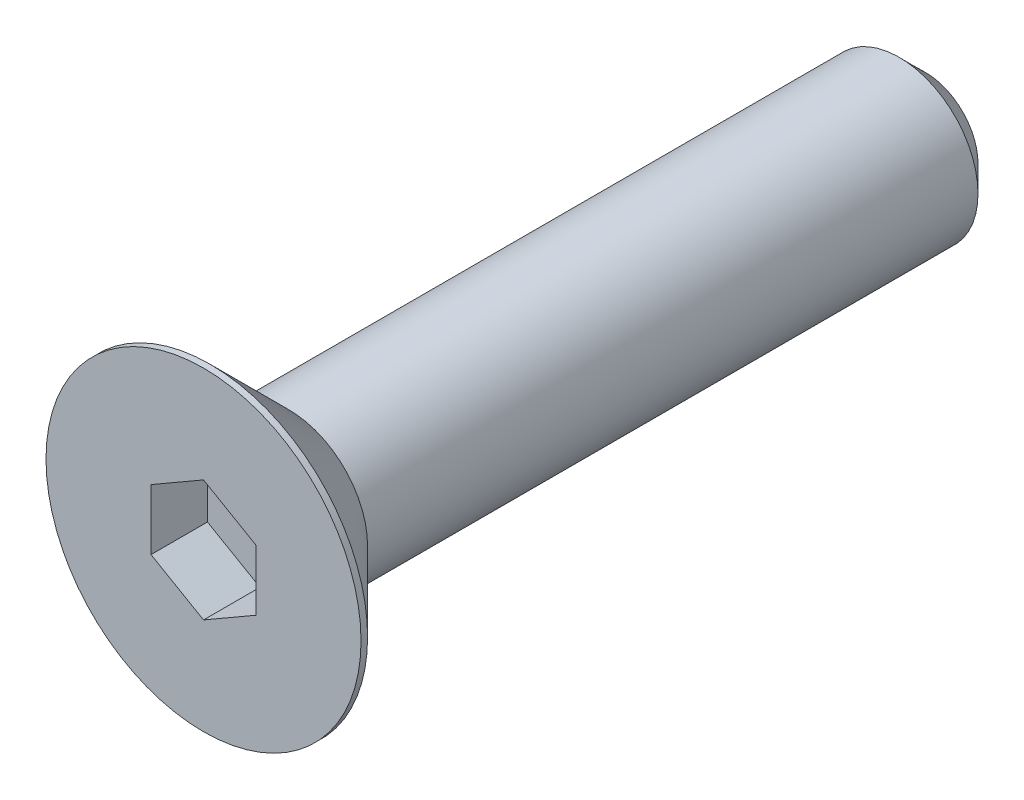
ISO-10303-21;
HEADER;
FILE_DESCRIPTION(('STEP AP214'),'2;1');
FILE_NAME('part.step','',(''),(''),'','','');
FILE_SCHEMA(('AUTOMOTIVE_DESIGN { 1 0 10303 214 1 1 1 1 }'));
ENDSEC;
DATA;
#1=APPLICATION_CONTEXT('core data for automotive mechanical design processes');
#2=APPLICATION_PROTOCOL_DEFINITION('international standard','automotive_design',2000,#1);
#3=PRODUCT_CONTEXT('',#1,'mechanical');
#4=PRODUCT('Part','Part','',(#3));
#5=PRODUCT_RELATED_PRODUCT_CATEGORY('part','',(#4));
#6=PRODUCT_DEFINITION_FORMATION('','',#4);
#7=PRODUCT_DEFINITION_CONTEXT('part definition',#1,'design');
#8=PRODUCT_DEFINITION('design','',#6,#7);
#9=PRODUCT_DEFINITION_SHAPE('','',#8);
#10=(LENGTH_UNIT() NAMED_UNIT(*) SI_UNIT(.MILLI.,.METRE.));
#11=(NAMED_UNIT(*) PLANE_ANGLE_UNIT() SI_UNIT($,.RADIAN.));
#12=(NAMED_UNIT(*) SI_UNIT($,.STERADIAN.) SOLID_ANGLE_UNIT());
#13=UNCERTAINTY_MEASURE_WITH_UNIT(LENGTH_MEASURE(1.E-05),#10,'distance_accuracy_value','');
#14=(GEOMETRIC_REPRESENTATION_CONTEXT(3) GLOBAL_UNCERTAINTY_ASSIGNED_CONTEXT((#13)) GLOBAL_UNIT_ASSIGNED_CONTEXT((#10,
#11,#12)) REPRESENTATION_CONTEXT('',''));
#15=CARTESIAN_POINT('',(0.,0.,0.));
#16=DIRECTION('',(0.,0.,1.));
#17=DIRECTION('',(1.,0.,0.));
#18=AXIS2_PLACEMENT_3D('',#15,#16,#17);
#19=CARTESIAN_POINT('',(0.,0.,0.));
#20=DIRECTION('',(0.,0.,1.));
#21=DIRECTION('',(1.,0.,0.));
#22=AXIS2_PLACEMENT_3D('',#19,#20,#21);
#23=CYLINDRICAL_SURFACE('',#22,6.);
#24=CARTESIAN_POINT('',(0.,0.,-53.));
#25=DIRECTION('',(0.,0.,1.));
#26=DIRECTION('',(1.,0.,0.));
#27=AXIS2_PLACEMENT_3D('',#24,#25,#26);
#28=CIRCLE('',#27,6.);
#29=CARTESIAN_POINT('',(6.,0.,-53.));
#30=VERTEX_POINT('',#29);
#31=EDGE_CURVE('E22',#30,#30,#28,.T.);
#32=ORIENTED_EDGE('',*,*,#31,.T.);
#33=EDGE_LOOP('',(#32));
#34=FACE_BOUND('',#33,.T.);
#35=CARTESIAN_POINT('',(0.,0.,-6.5));
#36=DIRECTION('',(0.,0.,1.));
#37=DIRECTION('',(1.,0.,0.));
#38=AXIS2_PLACEMENT_3D('',#35,#36,#37);
#39=CIRCLE('',#38,6.);
#40=CARTESIAN_POINT('',(6.,0.,-6.5));
#41=VERTEX_POINT('',#40);
#42=EDGE_CURVE('E116',#41,#41,#39,.T.);
#43=ORIENTED_EDGE('',*,*,#42,.F.);
#44=EDGE_LOOP('',(#43));
#45=FACE_BOUND('',#44,.T.);
#46=ADVANCED_FACE('F14',(#34,#45),#23,.T.);
#47=CARTESIAN_POINT('',(0.,0.,0.));
#48=DIRECTION('',(0.,0.,1.));
#49=DIRECTION('',(1.,0.,0.));
#50=AXIS2_PLACEMENT_3D('',#47,#48,#49);
#51=PLANE('',#50);
#52=DIRECTION('',(-0.866025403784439,0.5,0.));
#53=VECTOR('',#52,1.);
#54=CARTESIAN_POINT('',(4.,2.30940107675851,0.));
#55=LINE('',#54,#53);
#56=CARTESIAN_POINT('',(4.,2.30940107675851,0.));
#57=VERTEX_POINT('',#56);
#58=CARTESIAN_POINT('',(0.,4.61880215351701,0.));
#59=VERTEX_POINT('',#58);
#60=EDGE_CURVE('E29',#57,#59,#55,.T.);
#61=ORIENTED_EDGE('',*,*,#60,.F.);
#62=DIRECTION('',(0.,1.,0.));
#63=VECTOR('',#62,1.);
#64=CARTESIAN_POINT('',(4.,-2.30940107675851,0.));
#65=LINE('',#64,#63);
#66=CARTESIAN_POINT('',(4.,-2.30940107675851,0.));
#67=VERTEX_POINT('',#66);
#68=EDGE_CURVE('E112',#67,#57,#65,.T.);
#69=ORIENTED_EDGE('',*,*,#68,.F.);
#70=DIRECTION('',(0.866025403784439,0.5,0.));
#71=VECTOR('',#70,1.);
#72=CARTESIAN_POINT('',(0.,-4.61880215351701,0.));
#73=LINE('',#72,#71);
#74=CARTESIAN_POINT('',(0.,-4.61880215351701,0.));
#75=VERTEX_POINT('',#74);
#76=EDGE_CURVE('E110',#75,#67,#73,.T.);
#77=ORIENTED_EDGE('',*,*,#76,.F.);
#78=DIRECTION('',(0.866025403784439,-0.5,0.));
#79=VECTOR('',#78,1.);
#80=CARTESIAN_POINT('',(-4.,-2.30940107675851,0.));
#81=LINE('',#80,#79);
#82=CARTESIAN_POINT('',(-4.,-2.30940107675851,0.));
#83=VERTEX_POINT('',#82);
#84=EDGE_CURVE('E77',#83,#75,#81,.T.);
#85=ORIENTED_EDGE('',*,*,#84,.F.);
#86=DIRECTION('',(0.,-1.,0.));
#87=VECTOR('',#86,1.);
#88=CARTESIAN_POINT('',(-4.,2.30940107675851,0.));
#89=LINE('',#88,#87);
#90=CARTESIAN_POINT('',(-4.,2.30940107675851,0.));
#91=VERTEX_POINT('',#90);
#92=EDGE_CURVE('E106',#91,#83,#89,.T.);
#93=ORIENTED_EDGE('',*,*,#92,.F.);
#94=DIRECTION('',(-0.866025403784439,-0.5,0.));
#95=VECTOR('',#94,1.);
#96=CARTESIAN_POINT('',(0.,4.61880215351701,0.));
#97=LINE('',#96,#95);
#98=EDGE_CURVE('E103',#59,#91,#97,.T.);
#99=ORIENTED_EDGE('',*,*,#98,.F.);
#100=EDGE_LOOP('',(#61,#69,#77,#85,#93,#99));
#101=FACE_BOUND('',#100,.T.);
#102=CARTESIAN_POINT('',(0.,0.,0.));
#103=DIRECTION('',(0.,0.,1.));
#104=DIRECTION('',(1.,0.,0.));
#105=AXIS2_PLACEMENT_3D('',#102,#103,#104);
#106=CIRCLE('',#105,12.);
#107=CARTESIAN_POINT('',(12.,0.,0.));
#108=VERTEX_POINT('',#107);
#109=EDGE_CURVE('E127',#108,#108,#106,.T.);
#110=ORIENTED_EDGE('',*,*,#109,.T.);
#111=EDGE_LOOP('',(#110));
#112=FACE_BOUND('',#111,.T.);
#113=ADVANCED_FACE('F151',(#101,#112),#51,.T.);
#114=CARTESIAN_POINT('',(0.,0.,0.));
#115=DIRECTION('',(0.,0.,1.));
#116=DIRECTION('',(1.,0.,0.));
#117=AXIS2_PLACEMENT_3D('',#114,#115,#116);
#118=CYLINDRICAL_SURFACE('',#117,12.);
#119=CARTESIAN_POINT('',(0.,0.,-0.5));
#120=DIRECTION('',(0.,0.,1.));
#121=DIRECTION('',(1.,0.,0.));
#122=AXIS2_PLACEMENT_3D('',#119,#120,#121);
#123=CIRCLE('',#122,12.);
#124=CARTESIAN_POINT('',(12.,0.,-0.5));
#125=VERTEX_POINT('',#124);
#126=EDGE_CURVE('E124',#125,#125,#123,.T.);
#127=ORIENTED_EDGE('',*,*,#126,.T.);
#128=EDGE_LOOP('',(#127));
#129=FACE_BOUND('',#128,.T.);
#130=ORIENTED_EDGE('',*,*,#109,.F.);
#131=EDGE_LOOP('',(#130));
#132=FACE_BOUND('',#131,.T.);
#133=ADVANCED_FACE('F157',(#129,#132),#118,.T.);
#134=CARTESIAN_POINT('',(0.,0.,-0.5));
#135=DIRECTION('',(0.,0.,1.));
#136=DIRECTION('',(1.,0.,0.));
#137=AXIS2_PLACEMENT_3D('',#134,#135,#136);
#138=CONICAL_SURFACE('',#137,12.,0.78539816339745);
#139=ORIENTED_EDGE('',*,*,#42,.T.);
#140=EDGE_LOOP('',(#139));
#141=FACE_BOUND('',#140,.T.);
#142=ORIENTED_EDGE('',*,*,#126,.F.);
#143=EDGE_LOOP('',(#142));
#144=FACE_BOUND('',#143,.T.);
#145=ADVANCED_FACE('F146',(#141,#144),#138,.T.);
#146=CARTESIAN_POINT('',(0.,0.,-55.));
#147=DIRECTION('',(0.,0.,1.));
#148=DIRECTION('',(1.,0.,0.));
#149=AXIS2_PLACEMENT_3D('',#146,#147,#148);
#150=PLANE('',#149);
#151=CARTESIAN_POINT('',(0.,0.,-55.));
#152=DIRECTION('',(0.,0.,1.));
#153=DIRECTION('',(1.,0.,0.));
#154=AXIS2_PLACEMENT_3D('',#151,#152,#153);
#155=CIRCLE('',#154,4.);
#156=CARTESIAN_POINT('',(4.,0.,-55.));
#157=VERTEX_POINT('',#156);
#158=EDGE_CURVE('E9',#157,#157,#155,.F.);
#159=ORIENTED_EDGE('',*,*,#158,.T.);
#160=EDGE_LOOP('',(#159));
#161=FACE_BOUND('',#160,.T.);
#162=ADVANCED_FACE('F136',(#161),#150,.F.);
#163=CARTESIAN_POINT('',(0.,0.,-53.));
#164=DIRECTION('',(0.,0.,1.));
#165=DIRECTION('',(1.,0.,0.));
#166=AXIS2_PLACEMENT_3D('',#163,#164,#165);
#167=CONICAL_SURFACE('',#166,6.,0.785398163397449);
#168=ORIENTED_EDGE('',*,*,#158,.F.);
#169=EDGE_LOOP('',(#168));
#170=FACE_BOUND('',#169,.T.);
#171=ORIENTED_EDGE('',*,*,#31,.F.);
#172=EDGE_LOOP('',(#171));
#173=FACE_BOUND('',#172,.T.);
#174=ADVANCED_FACE('F16',(#170,#173),#167,.T.);
#175=CARTESIAN_POINT('',(4.,2.30940107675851,-4.3));
#176=DIRECTION('',(0.5,0.866025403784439,0.));
#177=DIRECTION('',(-0.866025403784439,0.5,0.));
#178=AXIS2_PLACEMENT_3D('',#175,#176,#177);
#179=PLANE('',#178);
#180=ORIENTED_EDGE('',*,*,#60,.T.);
#181=DIRECTION('',(0.,0.,1.));
#182=VECTOR('',#181,1.);
#183=CARTESIAN_POINT('',(0.,4.61880215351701,-4.3));
#184=LINE('',#183,#182);
#185=CARTESIAN_POINT('',(0.,4.61880215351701,-4.3));
#186=VERTEX_POINT('',#185);
#187=EDGE_CURVE('E59',#186,#59,#184,.T.);
#188=ORIENTED_EDGE('',*,*,#187,.F.);
#189=DIRECTION('',(-0.866025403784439,0.5,0.));
#190=VECTOR('',#189,1.);
#191=CARTESIAN_POINT('',(4.,2.30940107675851,-4.3));
#192=LINE('',#191,#190);
#193=CARTESIAN_POINT('',(4.,2.30940107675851,-4.3));
#194=VERTEX_POINT('',#193);
#195=EDGE_CURVE('E114',#194,#186,#192,.T.);
#196=ORIENTED_EDGE('',*,*,#195,.F.);
#197=DIRECTION('',(0.,0.,1.));
#198=VECTOR('',#197,1.);
#199=CARTESIAN_POINT('',(4.,2.30940107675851,-4.3));
#200=LINE('',#199,#198);
#201=EDGE_CURVE('E37',#194,#57,#200,.T.);
#202=ORIENTED_EDGE('',*,*,#201,.T.);
#203=EDGE_LOOP('',(#180,#188,#196,#202));
#204=FACE_BOUND('',#203,.T.);
#205=ADVANCED_FACE('F135',(#204),#179,.F.);
#206=CARTESIAN_POINT('',(4.,-2.30940107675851,-4.3));
#207=DIRECTION('',(1.,0.,0.));
#208=DIRECTION('',(0.,0.,-1.));
#209=AXIS2_PLACEMENT_3D('',#206,#207,#208);
#210=PLANE('',#209);
#211=ORIENTED_EDGE('',*,*,#68,.T.);
#212=ORIENTED_EDGE('',*,*,#201,.F.);
#213=DIRECTION('',(0.,1.,0.));
#214=VECTOR('',#213,1.);
#215=CARTESIAN_POINT('',(4.,-2.30940107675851,-4.3));
#216=LINE('',#215,#214);
#217=CARTESIAN_POINT('',(4.,-2.30940107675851,-4.3));
#218=VERTEX_POINT('',#217);
#219=EDGE_CURVE('E89',#218,#194,#216,.T.);
#220=ORIENTED_EDGE('',*,*,#219,.F.);
#221=DIRECTION('',(0.,0.,1.));
#222=VECTOR('',#221,1.);
#223=CARTESIAN_POINT('',(4.,-2.30940107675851,-4.3));
#224=LINE('',#223,#222);
#225=EDGE_CURVE('E81',#218,#67,#224,.T.);
#226=ORIENTED_EDGE('',*,*,#225,.T.);
#227=EDGE_LOOP('',(#211,#212,#220,#226));
#228=FACE_BOUND('',#227,.T.);
#229=ADVANCED_FACE('F144',(#228),#210,.F.);
#230=CARTESIAN_POINT('',(0.,-4.61880215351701,-4.3));
#231=DIRECTION('',(0.5,-0.866025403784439,0.));
#232=DIRECTION('',(0.866025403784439,0.5,0.));
#233=AXIS2_PLACEMENT_3D('',#230,#231,#232);
#234=PLANE('',#233);
#235=ORIENTED_EDGE('',*,*,#76,.T.);
#236=ORIENTED_EDGE('',*,*,#225,.F.);
#237=DIRECTION('',(0.866025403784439,0.5,0.));
#238=VECTOR('',#237,1.);
#239=CARTESIAN_POINT('',(0.,-4.61880215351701,-4.3));
#240=LINE('',#239,#238);
#241=CARTESIAN_POINT('',(0.,-4.61880215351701,-4.3));
#242=VERTEX_POINT('',#241);
#243=EDGE_CURVE('E85',#242,#218,#240,.T.);
#244=ORIENTED_EDGE('',*,*,#243,.F.);
#245=DIRECTION('',(0.,0.,1.));
#246=VECTOR('',#245,1.);
#247=CARTESIAN_POINT('',(0.,-4.61880215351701,-4.3));
#248=LINE('',#247,#246);
#249=EDGE_CURVE('E70',#242,#75,#248,.T.);
#250=ORIENTED_EDGE('',*,*,#249,.T.);
#251=EDGE_LOOP('',(#235,#236,#244,#250));
#252=FACE_BOUND('',#251,.T.);
#253=ADVANCED_FACE('F86',(#252),#234,.F.);
#254=CARTESIAN_POINT('',(-4.,-2.30940107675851,-4.3));
#255=DIRECTION('',(-0.5,-0.866025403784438,0.));
#256=DIRECTION('',(0.866025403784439,-0.5,0.));
#257=AXIS2_PLACEMENT_3D('',#254,#255,#256);
#258=PLANE('',#257);
#259=ORIENTED_EDGE('',*,*,#84,.T.);
#260=ORIENTED_EDGE('',*,*,#249,.F.);
#261=DIRECTION('',(0.866025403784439,-0.5,0.));
#262=VECTOR('',#261,1.);
#263=CARTESIAN_POINT('',(-4.,-2.30940107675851,-4.3));
#264=LINE('',#263,#262);
#265=CARTESIAN_POINT('',(-4.,-2.30940107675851,-4.3));
#266=VERTEX_POINT('',#265);
#267=EDGE_CURVE('E74',#266,#242,#264,.T.);
#268=ORIENTED_EDGE('',*,*,#267,.F.);
#269=DIRECTION('',(0.,0.,1.));
#270=VECTOR('',#269,1.);
#271=CARTESIAN_POINT('',(-4.,-2.30940107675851,-4.3));
#272=LINE('',#271,#270);
#273=EDGE_CURVE('E82',#266,#83,#272,.T.);
#274=ORIENTED_EDGE('',*,*,#273,.T.);
#275=EDGE_LOOP('',(#259,#260,#268,#274));
#276=FACE_BOUND('',#275,.T.);
#277=ADVANCED_FACE('F72',(#276),#258,.F.);
#278=CARTESIAN_POINT('',(-4.,2.30940107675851,-4.3));
#279=DIRECTION('',(-1.,0.,0.));
#280=DIRECTION('',(0.,-1.,0.));
#281=AXIS2_PLACEMENT_3D('',#278,#279,#280);
#282=PLANE('',#281);
#283=ORIENTED_EDGE('',*,*,#92,.T.);
#284=ORIENTED_EDGE('',*,*,#273,.F.);
#285=DIRECTION('',(0.,-1.,0.));
#286=VECTOR('',#285,1.);
#287=CARTESIAN_POINT('',(-4.,2.30940107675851,-4.3));
#288=LINE('',#287,#286);
#289=CARTESIAN_POINT('',(-4.,2.30940107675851,-4.3));
#290=VERTEX_POINT('',#289);
#291=EDGE_CURVE('E95',#290,#266,#288,.T.);
#292=ORIENTED_EDGE('',*,*,#291,.F.);
#293=DIRECTION('',(0.,0.,1.));
#294=VECTOR('',#293,1.);
#295=CARTESIAN_POINT('',(-4.,2.30940107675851,-4.3));
#296=LINE('',#295,#294);
#297=EDGE_CURVE('E119',#290,#91,#296,.T.);
#298=ORIENTED_EDGE('',*,*,#297,.T.);
#299=EDGE_LOOP('',(#283,#284,#292,#298));
#300=FACE_BOUND('',#299,.T.);
#301=ADVANCED_FACE('F232',(#300),#282,.F.);
#302=CARTESIAN_POINT('',(0.,4.61880215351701,-4.3));
#303=DIRECTION('',(-0.5,0.866025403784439,0.));
#304=DIRECTION('',(-0.866025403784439,-0.5,0.));
#305=AXIS2_PLACEMENT_3D('',#302,#303,#304);
#306=PLANE('',#305);
#307=ORIENTED_EDGE('',*,*,#98,.T.);
#308=ORIENTED_EDGE('',*,*,#297,.F.);
#309=DIRECTION('',(-0.866025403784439,-0.5,0.));
#310=VECTOR('',#309,1.);
#311=CARTESIAN_POINT('',(0.,4.61880215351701,-4.3));
#312=LINE('',#311,#310);
#313=EDGE_CURVE('E97',#186,#290,#312,.T.);
#314=ORIENTED_EDGE('',*,*,#313,.F.);
#315=ORIENTED_EDGE('',*,*,#187,.T.);
#316=EDGE_LOOP('',(#307,#308,#314,#315));
#317=FACE_BOUND('',#316,.T.);
#318=ADVANCED_FACE('F240',(#317),#306,.F.);
#319=CARTESIAN_POINT('',(0.,4.61880215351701,-4.3));
#320=DIRECTION('',(0.,0.,1.));
#321=DIRECTION('',(1.,0.,0.));
#322=AXIS2_PLACEMENT_3D('',#319,#320,#321);
#323=PLANE('',#322);
#324=ORIENTED_EDGE('',*,*,#195,.T.);
#325=ORIENTED_EDGE('',*,*,#313,.T.);
#326=ORIENTED_EDGE('',*,*,#291,.T.);
#327=ORIENTED_EDGE('',*,*,#267,.T.);
#328=ORIENTED_EDGE('',*,*,#243,.T.);
#329=ORIENTED_EDGE('',*,*,#219,.T.);
#330=EDGE_LOOP('',(#324,#325,#326,#327,#328,#329));
#331=FACE_BOUND('',#330,.T.);
#332=ADVANCED_FACE('F92',(#331),#323,.T.);
#333=CLOSED_SHELL('',(#46,#113,#133,#145,#162,#174,#205,#229,#253,#277,#301,#318,#332));
#334=MANIFOLD_SOLID_BREP('B1',#333);
#335=ADVANCED_BREP_SHAPE_REPRESENTATION('',(#18,#334),#14);
#336=SHAPE_DEFINITION_REPRESENTATION(#9,#335);
ENDSEC;
END-ISO-10303-21;
